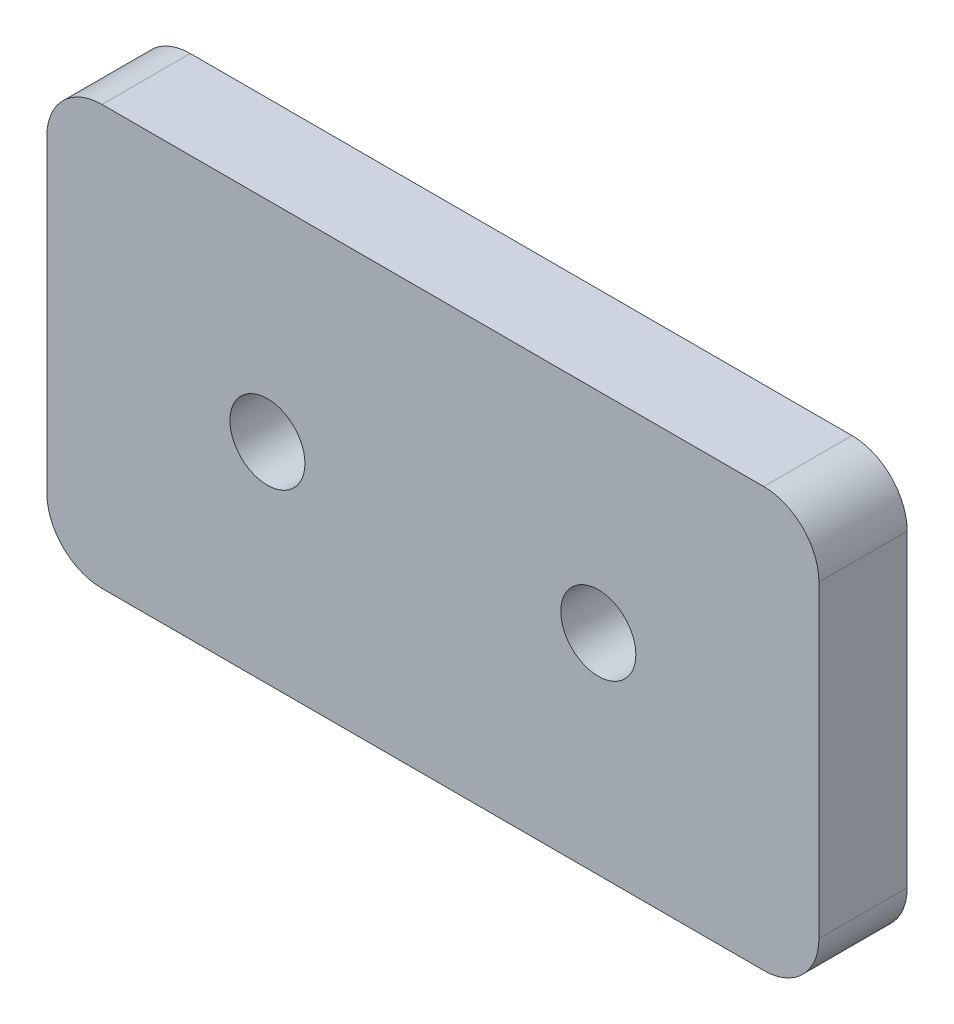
ISO-10303-21;
HEADER;
FILE_DESCRIPTION(('STEP AP214'),'2;1');
FILE_NAME('part.step','',(''),(''),'','','');
FILE_SCHEMA(('AUTOMOTIVE_DESIGN { 1 0 10303 214 1 1 1 1 }'));
ENDSEC;
DATA;
#1=APPLICATION_CONTEXT('core data for automotive mechanical design processes');
#2=APPLICATION_PROTOCOL_DEFINITION('international standard','automotive_design',2000,#1);
#3=PRODUCT_CONTEXT('',#1,'mechanical');
#4=PRODUCT('Part','Part','',(#3));
#5=PRODUCT_RELATED_PRODUCT_CATEGORY('part','',(#4));
#6=PRODUCT_DEFINITION_FORMATION('','',#4);
#7=PRODUCT_DEFINITION_CONTEXT('part definition',#1,'design');
#8=PRODUCT_DEFINITION('design','',#6,#7);
#9=PRODUCT_DEFINITION_SHAPE('','',#8);
#10=(LENGTH_UNIT() NAMED_UNIT(*) SI_UNIT(.MILLI.,.METRE.));
#11=(NAMED_UNIT(*) PLANE_ANGLE_UNIT() SI_UNIT($,.RADIAN.));
#12=(NAMED_UNIT(*) SI_UNIT($,.STERADIAN.) SOLID_ANGLE_UNIT());
#13=UNCERTAINTY_MEASURE_WITH_UNIT(LENGTH_MEASURE(1.E-05),#10,'distance_accuracy_value','');
#14=(GEOMETRIC_REPRESENTATION_CONTEXT(3) GLOBAL_UNCERTAINTY_ASSIGNED_CONTEXT((#13)) GLOBAL_UNIT_ASSIGNED_CONTEXT((#10,
#11,#12)) REPRESENTATION_CONTEXT('',''));
#15=CARTESIAN_POINT('',(0.,0.,0.));
#16=DIRECTION('',(0.,0.,1.));
#17=DIRECTION('',(1.,0.,0.));
#18=AXIS2_PLACEMENT_3D('',#15,#16,#17);
#19=CARTESIAN_POINT('',(0.,38.,8.));
#20=DIRECTION('',(0.,0.,-1.));
#21=DIRECTION('',(-1.,0.,0.));
#22=AXIS2_PLACEMENT_3D('',#19,#20,#21);
#23=PLANE('',#22);
#24=CARTESIAN_POINT('',(20.,19.,8.));
#25=DIRECTION('',(0.,0.,1.));
#26=DIRECTION('',(1.,0.,0.));
#27=AXIS2_PLACEMENT_3D('',#24,#25,#26);
#28=CIRCLE('',#27,3.4);
#29=CARTESIAN_POINT('',(23.4,19.,8.));
#30=VERTEX_POINT('',#29);
#31=EDGE_CURVE('E163',#30,#30,#28,.T.);
#32=ORIENTED_EDGE('',*,*,#31,.F.);
#33=EDGE_LOOP('',(#32));
#34=FACE_BOUND('',#33,.T.);
#35=DIRECTION('',(0.,1.,0.));
#36=VECTOR('',#35,1.);
#37=CARTESIAN_POINT('',(70.,0.,8.));
#38=LINE('',#37,#36);
#39=CARTESIAN_POINT('',(70.,5.,8.));
#40=VERTEX_POINT('',#39);
#41=CARTESIAN_POINT('',(70.,33.,8.));
#42=VERTEX_POINT('',#41);
#43=EDGE_CURVE('E170',#40,#42,#38,.T.);
#44=ORIENTED_EDGE('',*,*,#43,.T.);
#45=CARTESIAN_POINT('',(65.,33.,8.));
#46=DIRECTION('',(0.,0.,-1.));
#47=DIRECTION('',(-1.,0.,0.));
#48=AXIS2_PLACEMENT_3D('',#45,#46,#47);
#49=CIRCLE('',#48,5.);
#50=CARTESIAN_POINT('',(65.,38.,8.));
#51=VERTEX_POINT('',#50);
#52=EDGE_CURVE('E147',#42,#51,#49,.F.);
#53=ORIENTED_EDGE('',*,*,#52,.T.);
#54=DIRECTION('',(-1.,0.,0.));
#55=VECTOR('',#54,1.);
#56=CARTESIAN_POINT('',(0.,38.,8.));
#57=LINE('',#56,#55);
#58=CARTESIAN_POINT('',(5.,38.,8.));
#59=VERTEX_POINT('',#58);
#60=EDGE_CURVE('E118',#51,#59,#57,.T.);
#61=ORIENTED_EDGE('',*,*,#60,.T.);
#62=CARTESIAN_POINT('',(5.,33.,8.));
#63=DIRECTION('',(0.,0.,-1.));
#64=DIRECTION('',(-1.,0.,0.));
#65=AXIS2_PLACEMENT_3D('',#62,#63,#64);
#66=CIRCLE('',#65,5.);
#67=CARTESIAN_POINT('',(0.,33.,8.));
#68=VERTEX_POINT('',#67);
#69=EDGE_CURVE('E142',#59,#68,#66,.F.);
#70=ORIENTED_EDGE('',*,*,#69,.T.);
#71=DIRECTION('',(0.,-1.,0.));
#72=VECTOR('',#71,1.);
#73=CARTESIAN_POINT('',(0.,0.,8.));
#74=LINE('',#73,#72);
#75=CARTESIAN_POINT('',(0.,5.,8.));
#76=VERTEX_POINT('',#75);
#77=EDGE_CURVE('E125',#68,#76,#74,.T.);
#78=ORIENTED_EDGE('',*,*,#77,.T.);
#79=CARTESIAN_POINT('',(5.,5.,8.));
#80=DIRECTION('',(0.,0.,-1.));
#81=DIRECTION('',(-1.,0.,0.));
#82=AXIS2_PLACEMENT_3D('',#79,#80,#81);
#83=CIRCLE('',#82,5.);
#84=CARTESIAN_POINT('',(5.,0.,8.));
#85=VERTEX_POINT('',#84);
#86=EDGE_CURVE('E54',#76,#85,#83,.F.);
#87=ORIENTED_EDGE('',*,*,#86,.T.);
#88=DIRECTION('',(1.,0.,0.));
#89=VECTOR('',#88,1.);
#90=CARTESIAN_POINT('',(0.,0.,8.));
#91=LINE('',#90,#89);
#92=CARTESIAN_POINT('',(65.,0.,8.));
#93=VERTEX_POINT('',#92);
#94=EDGE_CURVE('E128',#85,#93,#91,.T.);
#95=ORIENTED_EDGE('',*,*,#94,.T.);
#96=CARTESIAN_POINT('',(65.,5.,8.));
#97=DIRECTION('',(0.,0.,-1.));
#98=DIRECTION('',(-1.,0.,0.));
#99=AXIS2_PLACEMENT_3D('',#96,#97,#98);
#100=CIRCLE('',#99,5.);
#101=EDGE_CURVE('E145',#93,#40,#100,.F.);
#102=ORIENTED_EDGE('',*,*,#101,.T.);
#103=EDGE_LOOP('',(#44,#53,#61,#70,#78,#87,#95,#102));
#104=FACE_BOUND('',#103,.T.);
#105=CARTESIAN_POINT('',(50.,19.,8.));
#106=DIRECTION('',(0.,0.,1.));
#107=DIRECTION('',(1.,0.,0.));
#108=AXIS2_PLACEMENT_3D('',#105,#106,#107);
#109=CIRCLE('',#108,3.4);
#110=CARTESIAN_POINT('',(53.4,19.,8.));
#111=VERTEX_POINT('',#110);
#112=EDGE_CURVE('E175',#111,#111,#109,.T.);
#113=ORIENTED_EDGE('',*,*,#112,.F.);
#114=EDGE_LOOP('',(#113));
#115=FACE_BOUND('',#114,.T.);
#116=ADVANCED_FACE('F32',(#34,#104,#115),#23,.F.);
#117=CARTESIAN_POINT('',(0.,38.,0.));
#118=DIRECTION('',(0.,0.,-1.));
#119=DIRECTION('',(-1.,0.,0.));
#120=AXIS2_PLACEMENT_3D('',#117,#118,#119);
#121=PLANE('',#120);
#122=CARTESIAN_POINT('',(20.,19.,0.));
#123=DIRECTION('',(0.,0.,1.));
#124=DIRECTION('',(1.,0.,0.));
#125=AXIS2_PLACEMENT_3D('',#122,#123,#124);
#126=CIRCLE('',#125,3.4);
#127=CARTESIAN_POINT('',(23.4,19.,0.));
#128=VERTEX_POINT('',#127);
#129=EDGE_CURVE('E166',#128,#128,#126,.T.);
#130=ORIENTED_EDGE('',*,*,#129,.T.);
#131=EDGE_LOOP('',(#130));
#132=FACE_BOUND('',#131,.T.);
#133=DIRECTION('',(-1.,0.,0.));
#134=VECTOR('',#133,1.);
#135=CARTESIAN_POINT('',(0.,38.,0.));
#136=LINE('',#135,#134);
#137=CARTESIAN_POINT('',(65.,38.,0.));
#138=VERTEX_POINT('',#137);
#139=CARTESIAN_POINT('',(5.,38.,0.));
#140=VERTEX_POINT('',#139);
#141=EDGE_CURVE('E115',#138,#140,#136,.T.);
#142=ORIENTED_EDGE('',*,*,#141,.F.);
#143=CARTESIAN_POINT('',(65.,33.,0.));
#144=DIRECTION('',(0.,0.,-1.));
#145=DIRECTION('',(-1.,0.,0.));
#146=AXIS2_PLACEMENT_3D('',#143,#144,#145);
#147=CIRCLE('',#146,5.);
#148=CARTESIAN_POINT('',(70.,33.,0.));
#149=VERTEX_POINT('',#148);
#150=EDGE_CURVE('E98',#138,#149,#147,.T.);
#151=ORIENTED_EDGE('',*,*,#150,.T.);
#152=DIRECTION('',(0.,1.,0.));
#153=VECTOR('',#152,1.);
#154=CARTESIAN_POINT('',(70.,0.,0.));
#155=LINE('',#154,#153);
#156=CARTESIAN_POINT('',(70.,5.,0.));
#157=VERTEX_POINT('',#156);
#158=EDGE_CURVE('E126',#157,#149,#155,.T.);
#159=ORIENTED_EDGE('',*,*,#158,.F.);
#160=CARTESIAN_POINT('',(65.,5.,0.));
#161=DIRECTION('',(0.,0.,-1.));
#162=DIRECTION('',(-1.,0.,0.));
#163=AXIS2_PLACEMENT_3D('',#160,#161,#162);
#164=CIRCLE('',#163,5.);
#165=CARTESIAN_POINT('',(65.,0.,0.));
#166=VERTEX_POINT('',#165);
#167=EDGE_CURVE('E109',#157,#166,#164,.T.);
#168=ORIENTED_EDGE('',*,*,#167,.T.);
#169=DIRECTION('',(1.,0.,0.));
#170=VECTOR('',#169,1.);
#171=CARTESIAN_POINT('',(0.,0.,0.));
#172=LINE('',#171,#170);
#173=CARTESIAN_POINT('',(5.,0.,0.));
#174=VERTEX_POINT('',#173);
#175=EDGE_CURVE('E130',#174,#166,#172,.T.);
#176=ORIENTED_EDGE('',*,*,#175,.F.);
#177=CARTESIAN_POINT('',(5.,5.,0.));
#178=DIRECTION('',(0.,0.,-1.));
#179=DIRECTION('',(-1.,0.,0.));
#180=AXIS2_PLACEMENT_3D('',#177,#178,#179);
#181=CIRCLE('',#180,5.);
#182=CARTESIAN_POINT('',(0.,5.,0.));
#183=VERTEX_POINT('',#182);
#184=EDGE_CURVE('E136',#174,#183,#181,.T.);
#185=ORIENTED_EDGE('',*,*,#184,.T.);
#186=DIRECTION('',(0.,-1.,0.));
#187=VECTOR('',#186,1.);
#188=CARTESIAN_POINT('',(0.,0.,0.));
#189=LINE('',#188,#187);
#190=CARTESIAN_POINT('',(0.,33.,0.));
#191=VERTEX_POINT('',#190);
#192=EDGE_CURVE('E158',#191,#183,#189,.T.);
#193=ORIENTED_EDGE('',*,*,#192,.F.);
#194=CARTESIAN_POINT('',(5.,33.,0.));
#195=DIRECTION('',(0.,0.,-1.));
#196=DIRECTION('',(-1.,0.,0.));
#197=AXIS2_PLACEMENT_3D('',#194,#195,#196);
#198=CIRCLE('',#197,5.);
#199=EDGE_CURVE('E119',#191,#140,#198,.T.);
#200=ORIENTED_EDGE('',*,*,#199,.T.);
#201=EDGE_LOOP('',(#142,#151,#159,#168,#176,#185,#193,#200));
#202=FACE_BOUND('',#201,.T.);
#203=CARTESIAN_POINT('',(50.,19.,0.));
#204=DIRECTION('',(0.,0.,1.));
#205=DIRECTION('',(1.,0.,0.));
#206=AXIS2_PLACEMENT_3D('',#203,#204,#205);
#207=CIRCLE('',#206,3.4);
#208=CARTESIAN_POINT('',(53.4,19.,0.));
#209=VERTEX_POINT('',#208);
#210=EDGE_CURVE('E177',#209,#209,#207,.T.);
#211=ORIENTED_EDGE('',*,*,#210,.T.);
#212=EDGE_LOOP('',(#211));
#213=FACE_BOUND('',#212,.T.);
#214=ADVANCED_FACE('F122',(#132,#202,#213),#121,.T.);
#215=CARTESIAN_POINT('',(0.,0.,8.));
#216=DIRECTION('',(1.,0.,0.));
#217=DIRECTION('',(0.,0.,-1.));
#218=AXIS2_PLACEMENT_3D('',#215,#216,#217);
#219=PLANE('',#218);
#220=ORIENTED_EDGE('',*,*,#192,.T.);
#221=DIRECTION('',(0.,0.,-1.));
#222=VECTOR('',#221,1.);
#223=CARTESIAN_POINT('',(0.,5.,8.));
#224=LINE('',#223,#222);
#225=EDGE_CURVE('E11',#183,#76,#224,.F.);
#226=ORIENTED_EDGE('',*,*,#225,.T.);
#227=ORIENTED_EDGE('',*,*,#77,.F.);
#228=DIRECTION('',(0.,0.,-1.));
#229=VECTOR('',#228,1.);
#230=CARTESIAN_POINT('',(0.,33.,8.));
#231=LINE('',#230,#229);
#232=EDGE_CURVE('E40',#68,#191,#231,.T.);
#233=ORIENTED_EDGE('',*,*,#232,.T.);
#234=EDGE_LOOP('',(#220,#226,#227,#233));
#235=FACE_BOUND('',#234,.T.);
#236=ADVANCED_FACE('F157',(#235),#219,.F.);
#237=CARTESIAN_POINT('',(0.,0.,8.));
#238=DIRECTION('',(0.,1.,0.));
#239=DIRECTION('',(0.,0.,1.));
#240=AXIS2_PLACEMENT_3D('',#237,#238,#239);
#241=PLANE('',#240);
#242=ORIENTED_EDGE('',*,*,#175,.T.);
#243=DIRECTION('',(0.,0.,-1.));
#244=VECTOR('',#243,1.);
#245=CARTESIAN_POINT('',(65.,0.,8.));
#246=LINE('',#245,#244);
#247=EDGE_CURVE('E47',#166,#93,#246,.F.);
#248=ORIENTED_EDGE('',*,*,#247,.T.);
#249=ORIENTED_EDGE('',*,*,#94,.F.);
#250=DIRECTION('',(0.,0.,-1.));
#251=VECTOR('',#250,1.);
#252=CARTESIAN_POINT('',(5.,0.,8.));
#253=LINE('',#252,#251);
#254=EDGE_CURVE('E149',#85,#174,#253,.T.);
#255=ORIENTED_EDGE('',*,*,#254,.T.);
#256=EDGE_LOOP('',(#242,#248,#249,#255));
#257=FACE_BOUND('',#256,.T.);
#258=ADVANCED_FACE('F204',(#257),#241,.F.);
#259=CARTESIAN_POINT('',(70.,0.,8.));
#260=DIRECTION('',(-1.,0.,0.));
#261=DIRECTION('',(0.,0.,1.));
#262=AXIS2_PLACEMENT_3D('',#259,#260,#261);
#263=PLANE('',#262);
#264=ORIENTED_EDGE('',*,*,#158,.T.);
#265=DIRECTION('',(0.,0.,-1.));
#266=VECTOR('',#265,1.);
#267=CARTESIAN_POINT('',(70.,33.,8.));
#268=LINE('',#267,#266);
#269=EDGE_CURVE('E103',#149,#42,#268,.F.);
#270=ORIENTED_EDGE('',*,*,#269,.T.);
#271=ORIENTED_EDGE('',*,*,#43,.F.);
#272=DIRECTION('',(0.,0.,-1.));
#273=VECTOR('',#272,1.);
#274=CARTESIAN_POINT('',(70.,5.,8.));
#275=LINE('',#274,#273);
#276=EDGE_CURVE('E108',#40,#157,#275,.T.);
#277=ORIENTED_EDGE('',*,*,#276,.T.);
#278=EDGE_LOOP('',(#264,#270,#271,#277));
#279=FACE_BOUND('',#278,.T.);
#280=ADVANCED_FACE('F201',(#279),#263,.F.);
#281=CARTESIAN_POINT('',(0.,38.,8.));
#282=DIRECTION('',(0.,-1.,0.));
#283=DIRECTION('',(0.,0.,-1.));
#284=AXIS2_PLACEMENT_3D('',#281,#282,#283);
#285=PLANE('',#284);
#286=ORIENTED_EDGE('',*,*,#60,.F.);
#287=DIRECTION('',(0.,0.,-1.));
#288=VECTOR('',#287,1.);
#289=CARTESIAN_POINT('',(65.,38.,8.));
#290=LINE('',#289,#288);
#291=EDGE_CURVE('E102',#51,#138,#290,.T.);
#292=ORIENTED_EDGE('',*,*,#291,.T.);
#293=ORIENTED_EDGE('',*,*,#141,.T.);
#294=DIRECTION('',(0.,0.,-1.));
#295=VECTOR('',#294,1.);
#296=CARTESIAN_POINT('',(5.,38.,8.));
#297=LINE('',#296,#295);
#298=EDGE_CURVE('E120',#140,#59,#297,.F.);
#299=ORIENTED_EDGE('',*,*,#298,.T.);
#300=EDGE_LOOP('',(#286,#292,#293,#299));
#301=FACE_BOUND('',#300,.T.);
#302=ADVANCED_FACE('F114',(#301),#285,.F.);
#303=CARTESIAN_POINT('',(20.,19.,8.));
#304=DIRECTION('',(0.,0.,-1.));
#305=DIRECTION('',(-1.,0.,0.));
#306=AXIS2_PLACEMENT_3D('',#303,#304,#305);
#307=CYLINDRICAL_SURFACE('',#306,3.4);
#308=ORIENTED_EDGE('',*,*,#31,.T.);
#309=EDGE_LOOP('',(#308));
#310=FACE_BOUND('',#309,.T.);
#311=ORIENTED_EDGE('',*,*,#129,.F.);
#312=EDGE_LOOP('',(#311));
#313=FACE_BOUND('',#312,.T.);
#314=ADVANCED_FACE('F196',(#310,#313),#307,.F.);
#315=CARTESIAN_POINT('',(50.,19.,8.));
#316=DIRECTION('',(0.,0.,-1.));
#317=DIRECTION('',(-1.,0.,0.));
#318=AXIS2_PLACEMENT_3D('',#315,#316,#317);
#319=CYLINDRICAL_SURFACE('',#318,3.4);
#320=ORIENTED_EDGE('',*,*,#112,.T.);
#321=EDGE_LOOP('',(#320));
#322=FACE_BOUND('',#321,.T.);
#323=ORIENTED_EDGE('',*,*,#210,.F.);
#324=EDGE_LOOP('',(#323));
#325=FACE_BOUND('',#324,.T.);
#326=ADVANCED_FACE('F183',(#322,#325),#319,.F.);
#327=CARTESIAN_POINT('',(65.,33.,8.));
#328=DIRECTION('',(0.,0.,-1.));
#329=DIRECTION('',(-1.,0.,0.));
#330=AXIS2_PLACEMENT_3D('',#327,#328,#329);
#331=CYLINDRICAL_SURFACE('',#330,5.);
#332=ORIENTED_EDGE('',*,*,#52,.F.);
#333=ORIENTED_EDGE('',*,*,#269,.F.);
#334=ORIENTED_EDGE('',*,*,#150,.F.);
#335=ORIENTED_EDGE('',*,*,#291,.F.);
#336=EDGE_LOOP('',(#332,#333,#334,#335));
#337=FACE_BOUND('',#336,.T.);
#338=ADVANCED_FACE('F101',(#337),#331,.T.);
#339=CARTESIAN_POINT('',(65.,5.,8.));
#340=DIRECTION('',(0.,0.,-1.));
#341=DIRECTION('',(-1.,0.,0.));
#342=AXIS2_PLACEMENT_3D('',#339,#340,#341);
#343=CYLINDRICAL_SURFACE('',#342,5.);
#344=ORIENTED_EDGE('',*,*,#101,.F.);
#345=ORIENTED_EDGE('',*,*,#247,.F.);
#346=ORIENTED_EDGE('',*,*,#167,.F.);
#347=ORIENTED_EDGE('',*,*,#276,.F.);
#348=EDGE_LOOP('',(#344,#345,#346,#347));
#349=FACE_BOUND('',#348,.T.);
#350=ADVANCED_FACE('F212',(#349),#343,.T.);
#351=CARTESIAN_POINT('',(5.,5.,8.));
#352=DIRECTION('',(0.,0.,-1.));
#353=DIRECTION('',(-1.,0.,0.));
#354=AXIS2_PLACEMENT_3D('',#351,#352,#353);
#355=CYLINDRICAL_SURFACE('',#354,5.);
#356=ORIENTED_EDGE('',*,*,#86,.F.);
#357=ORIENTED_EDGE('',*,*,#225,.F.);
#358=ORIENTED_EDGE('',*,*,#184,.F.);
#359=ORIENTED_EDGE('',*,*,#254,.F.);
#360=EDGE_LOOP('',(#356,#357,#358,#359));
#361=FACE_BOUND('',#360,.T.);
#362=ADVANCED_FACE('F214',(#361),#355,.T.);
#363=CARTESIAN_POINT('',(5.,33.,8.));
#364=DIRECTION('',(0.,0.,-1.));
#365=DIRECTION('',(-1.,0.,0.));
#366=AXIS2_PLACEMENT_3D('',#363,#364,#365);
#367=CYLINDRICAL_SURFACE('',#366,5.);
#368=ORIENTED_EDGE('',*,*,#69,.F.);
#369=ORIENTED_EDGE('',*,*,#298,.F.);
#370=ORIENTED_EDGE('',*,*,#199,.F.);
#371=ORIENTED_EDGE('',*,*,#232,.F.);
#372=EDGE_LOOP('',(#368,#369,#370,#371));
#373=FACE_BOUND('',#372,.T.);
#374=ADVANCED_FACE('F34',(#373),#367,.T.);
#375=CLOSED_SHELL('',(#116,#214,#236,#258,#280,#302,#314,#326,#338,#350,#362,#374));
#376=MANIFOLD_SOLID_BREP('B2',#375);
#377=ADVANCED_BREP_SHAPE_REPRESENTATION('',(#18,#376),#14);
#378=SHAPE_DEFINITION_REPRESENTATION(#9,#377);
ENDSEC;
END-ISO-10303-21;
